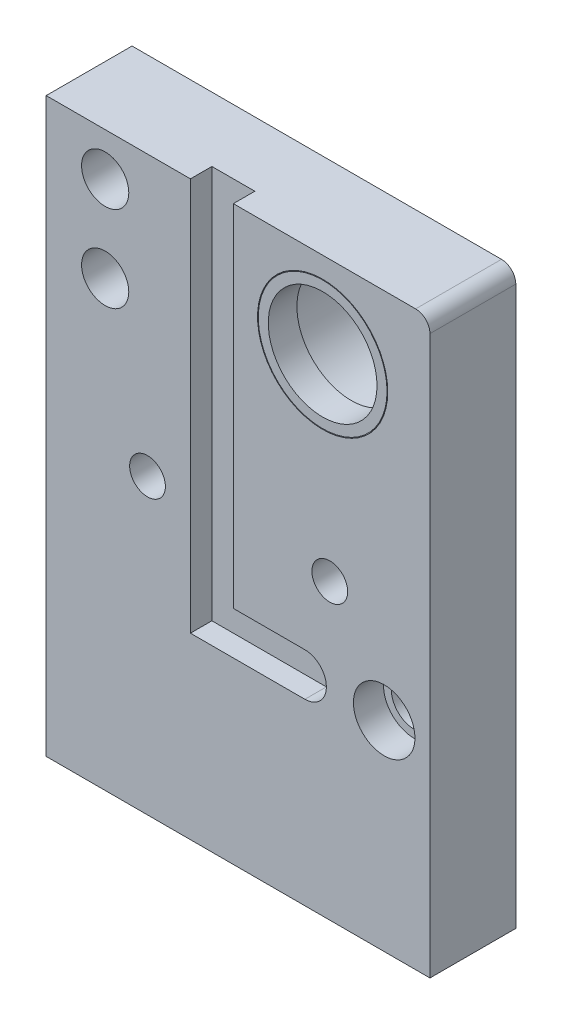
ISO-10303-21;
HEADER;
FILE_DESCRIPTION(('STEP AP214'),'2;1');
FILE_NAME('part.step','',(''),(''),'','','');
FILE_SCHEMA(('AUTOMOTIVE_DESIGN { 1 0 10303 214 1 1 1 1 }'));
ENDSEC;
DATA;
#1=APPLICATION_CONTEXT('core data for automotive mechanical design processes');
#2=APPLICATION_PROTOCOL_DEFINITION('international standard','automotive_design',2000,#1);
#3=PRODUCT_CONTEXT('',#1,'mechanical');
#4=PRODUCT('Part','Part','',(#3));
#5=PRODUCT_RELATED_PRODUCT_CATEGORY('part','',(#4));
#6=PRODUCT_DEFINITION_FORMATION('','',#4);
#7=PRODUCT_DEFINITION_CONTEXT('part definition',#1,'design');
#8=PRODUCT_DEFINITION('design','',#6,#7);
#9=PRODUCT_DEFINITION_SHAPE('','',#8);
#10=(LENGTH_UNIT() NAMED_UNIT(*) SI_UNIT(.MILLI.,.METRE.));
#11=(NAMED_UNIT(*) PLANE_ANGLE_UNIT() SI_UNIT($,.RADIAN.));
#12=(NAMED_UNIT(*) SI_UNIT($,.STERADIAN.) SOLID_ANGLE_UNIT());
#13=UNCERTAINTY_MEASURE_WITH_UNIT(LENGTH_MEASURE(1.E-05),#10,'distance_accuracy_value','');
#14=(GEOMETRIC_REPRESENTATION_CONTEXT(3) GLOBAL_UNCERTAINTY_ASSIGNED_CONTEXT((#13)) GLOBAL_UNIT_ASSIGNED_CONTEXT((#10,
#11,#12)) REPRESENTATION_CONTEXT('',''));
#15=CARTESIAN_POINT('',(0.,0.,0.));
#16=DIRECTION('',(0.,0.,1.));
#17=DIRECTION('',(1.,0.,0.));
#18=AXIS2_PLACEMENT_3D('',#15,#16,#17);
#19=CARTESIAN_POINT('',(19.32061,34.,4.));
#20=DIRECTION('',(0.,0.,1.));
#21=DIRECTION('',(1.,0.,0.));
#22=AXIS2_PLACEMENT_3D('',#19,#20,#21);
#23=CYLINDRICAL_SURFACE('',#22,4.50000000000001);
#24=CARTESIAN_POINT('',(19.32061,34.,4.));
#25=DIRECTION('',(0.,0.,1.));
#26=DIRECTION('',(1.,0.,0.));
#27=AXIS2_PLACEMENT_3D('',#24,#25,#26);
#28=CIRCLE('',#27,4.50000000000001);
#29=CARTESIAN_POINT('',(23.82061,34.,4.));
#30=VERTEX_POINT('',#29);
#31=EDGE_CURVE('E13',#30,#30,#28,.T.);
#32=ORIENTED_EDGE('',*,*,#31,.T.);
#33=EDGE_LOOP('',(#32));
#34=FACE_BOUND('',#33,.T.);
#35=CARTESIAN_POINT('',(19.32061,34.,6.));
#36=DIRECTION('',(0.,0.,1.));
#37=DIRECTION('',(1.,0.,0.));
#38=AXIS2_PLACEMENT_3D('',#35,#36,#37);
#39=CIRCLE('',#38,4.50000000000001);
#40=CARTESIAN_POINT('',(23.82061,34.,6.));
#41=VERTEX_POINT('',#40);
#42=EDGE_CURVE('E60',#41,#41,#39,.T.);
#43=ORIENTED_EDGE('',*,*,#42,.F.);
#44=EDGE_LOOP('',(#43));
#45=FACE_BOUND('',#44,.T.);
#46=ADVANCED_FACE('F57',(#34,#45),#23,.T.);
#47=CARTESIAN_POINT('',(19.32061,34.,4.));
#48=DIRECTION('',(0.,0.,1.));
#49=DIRECTION('',(1.,0.,0.));
#50=AXIS2_PLACEMENT_3D('',#47,#48,#49);
#51=PLANE('',#50);
#52=CARTESIAN_POINT('',(19.32061,34.,4.));
#53=DIRECTION('',(0.,0.,1.));
#54=DIRECTION('',(1.,0.,0.));
#55=AXIS2_PLACEMENT_3D('',#52,#53,#54);
#56=CIRCLE('',#55,3.8);
#57=CARTESIAN_POINT('',(23.12061,34.,4.));
#58=VERTEX_POINT('',#57);
#59=EDGE_CURVE('E67',#58,#58,#56,.T.);
#60=ORIENTED_EDGE('',*,*,#59,.T.);
#61=EDGE_LOOP('',(#60));
#62=FACE_BOUND('',#61,.T.);
#63=ORIENTED_EDGE('',*,*,#31,.F.);
#64=EDGE_LOOP('',(#63));
#65=FACE_BOUND('',#64,.T.);
#66=ADVANCED_FACE('F75',(#62,#65),#51,.F.);
#67=CARTESIAN_POINT('',(19.32061,34.,6.));
#68=DIRECTION('',(0.,0.,1.));
#69=DIRECTION('',(1.,0.,0.));
#70=AXIS2_PLACEMENT_3D('',#67,#68,#69);
#71=PLANE('',#70);
#72=CARTESIAN_POINT('',(19.32061,34.,6.));
#73=DIRECTION('',(0.,0.,1.));
#74=DIRECTION('',(1.,0.,0.));
#75=AXIS2_PLACEMENT_3D('',#72,#73,#74);
#76=CIRCLE('',#75,3.8);
#77=CARTESIAN_POINT('',(23.12061,34.,6.));
#78=VERTEX_POINT('',#77);
#79=EDGE_CURVE('E69',#78,#78,#76,.T.);
#80=ORIENTED_EDGE('',*,*,#79,.F.);
#81=EDGE_LOOP('',(#80));
#82=FACE_BOUND('',#81,.T.);
#83=ORIENTED_EDGE('',*,*,#42,.T.);
#84=EDGE_LOOP('',(#83));
#85=FACE_BOUND('',#84,.T.);
#86=ADVANCED_FACE('F81',(#82,#85),#71,.T.);
#87=CARTESIAN_POINT('',(19.32061,34.,4.));
#88=DIRECTION('',(0.,0.,1.));
#89=DIRECTION('',(1.,0.,0.));
#90=AXIS2_PLACEMENT_3D('',#87,#88,#89);
#91=CYLINDRICAL_SURFACE('',#90,3.8);
#92=ORIENTED_EDGE('',*,*,#59,.F.);
#93=EDGE_LOOP('',(#92));
#94=FACE_BOUND('',#93,.T.);
#95=ORIENTED_EDGE('',*,*,#79,.T.);
#96=EDGE_LOOP('',(#95));
#97=FACE_BOUND('',#96,.T.);
#98=ADVANCED_FACE('F78',(#94,#97),#91,.F.);
#99=CLOSED_SHELL('',(#46,#66,#86,#98));
#100=MANIFOLD_SOLID_BREP('B2',#99);
#101=CARTESIAN_POINT('',(23.62061,14.,6.));
#102=DIRECTION('',(0.,0.,-1.));
#103=DIRECTION('',(-1.,0.,0.));
#104=AXIS2_PLACEMENT_3D('',#101,#102,#103);
#105=CYLINDRICAL_SURFACE('',#104,1.6);
#106=CARTESIAN_POINT('',(23.62061,14.,0.));
#107=DIRECTION('',(0.,0.,1.));
#108=DIRECTION('',(1.,0.,0.));
#109=AXIS2_PLACEMENT_3D('',#106,#107,#108);
#110=CIRCLE('',#109,1.6);
#111=CARTESIAN_POINT('',(25.22061,14.,0.));
#112=VERTEX_POINT('',#111);
#113=EDGE_CURVE('E277',#112,#112,#110,.T.);
#114=ORIENTED_EDGE('',*,*,#113,.F.);
#115=EDGE_LOOP('',(#114));
#116=FACE_BOUND('',#115,.T.);
#117=CARTESIAN_POINT('',(23.62061,14.,3.9));
#118=DIRECTION('',(0.,0.,1.));
#119=DIRECTION('',(1.,0.,0.));
#120=AXIS2_PLACEMENT_3D('',#117,#118,#119);
#121=CIRCLE('',#120,1.6);
#122=CARTESIAN_POINT('',(25.22061,14.,3.9));
#123=VERTEX_POINT('',#122);
#124=EDGE_CURVE('E251',#123,#123,#121,.T.);
#125=ORIENTED_EDGE('',*,*,#124,.T.);
#126=EDGE_LOOP('',(#125));
#127=FACE_BOUND('',#126,.T.);
#128=ADVANCED_FACE('F125',(#116,#127),#105,.F.);
#129=CARTESIAN_POINT('',(0.,0.,6.));
#130=DIRECTION('',(0.,0.,-1.));
#131=DIRECTION('',(-1.,0.,0.));
#132=AXIS2_PLACEMENT_3D('',#129,#130,#131);
#133=PLANE('',#132);
#134=CARTESIAN_POINT('',(7.08031781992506,20.5,6.));
#135=DIRECTION('',(0.,0.,1.));
#136=DIRECTION('',(1.,0.,0.));
#137=AXIS2_PLACEMENT_3D('',#134,#135,#136);
#138=CIRCLE('',#137,1.25);
#139=CARTESIAN_POINT('',(8.33031781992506,20.5,6.));
#140=VERTEX_POINT('',#139);
#141=EDGE_CURVE('E343',#140,#140,#138,.T.);
#142=ORIENTED_EDGE('',*,*,#141,.F.);
#143=EDGE_LOOP('',(#142));
#144=FACE_BOUND('',#143,.T.);
#145=CARTESIAN_POINT('',(19.82061,20.5,6.));
#146=DIRECTION('',(0.,0.,1.));
#147=DIRECTION('',(1.,0.,0.));
#148=AXIS2_PLACEMENT_3D('',#145,#146,#147);
#149=CIRCLE('',#148,1.25);
#150=CARTESIAN_POINT('',(21.07061,20.5,6.));
#151=VERTEX_POINT('',#150);
#152=EDGE_CURVE('E348',#151,#151,#149,.T.);
#153=ORIENTED_EDGE('',*,*,#152,.F.);
#154=EDGE_LOOP('',(#153));
#155=FACE_BOUND('',#154,.T.);
#156=CARTESIAN_POINT('',(23.62061,14.,6.));
#157=DIRECTION('',(0.,0.,1.));
#158=DIRECTION('',(1.,0.,0.));
#159=AXIS2_PLACEMENT_3D('',#156,#157,#158);
#160=CIRCLE('',#159,2.15);
#161=CARTESIAN_POINT('',(25.77061,14.,6.));
#162=VERTEX_POINT('',#161);
#163=EDGE_CURVE('E252',#162,#162,#160,.T.);
#164=ORIENTED_EDGE('',*,*,#163,.F.);
#165=EDGE_LOOP('',(#164));
#166=FACE_BOUND('',#165,.T.);
#167=DIRECTION('',(-1.,0.,0.));
#168=VECTOR('',#167,1.);
#169=CARTESIAN_POINT('',(0.,40.,6.));
#170=LINE('',#169,#168);
#171=CARTESIAN_POINT('',(25.82061,40.,6.));
#172=VERTEX_POINT('',#171);
#173=CARTESIAN_POINT('',(13.0803178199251,40.,6.));
#174=VERTEX_POINT('',#173);
#175=EDGE_CURVE('E298',#172,#174,#170,.T.);
#176=ORIENTED_EDGE('',*,*,#175,.T.);
#177=DIRECTION('',(0.,1.,0.));
#178=VECTOR('',#177,1.);
#179=CARTESIAN_POINT('',(13.0803178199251,15.5,6.));
#180=LINE('',#179,#178);
#181=CARTESIAN_POINT('',(13.0803178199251,15.5,6.));
#182=VERTEX_POINT('',#181);
#183=EDGE_CURVE('E340',#182,#174,#180,.T.);
#184=ORIENTED_EDGE('',*,*,#183,.F.);
#185=DIRECTION('',(-1.,0.,0.));
#186=VECTOR('',#185,1.);
#187=CARTESIAN_POINT('',(13.0803178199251,15.5,6.));
#188=LINE('',#187,#186);
#189=CARTESIAN_POINT('',(18.0803178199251,15.5,6.));
#190=VERTEX_POINT('',#189);
#191=EDGE_CURVE('E355',#190,#182,#188,.T.);
#192=ORIENTED_EDGE('',*,*,#191,.F.);
#193=CARTESIAN_POINT('',(18.0803178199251,14.,6.));
#194=DIRECTION('',(0.,0.,-1.));
#195=DIRECTION('',(-1.,0.,0.));
#196=AXIS2_PLACEMENT_3D('',#193,#194,#195);
#197=CIRCLE('',#196,1.5);
#198=CARTESIAN_POINT('',(19.5803178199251,14.,6.));
#199=VERTEX_POINT('',#198);
#200=EDGE_CURVE('E55',#190,#199,#197,.T.);
#201=ORIENTED_EDGE('',*,*,#200,.T.);
#202=CARTESIAN_POINT('',(18.0803178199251,14.,6.));
#203=DIRECTION('',(0.,0.,-1.));
#204=DIRECTION('',(-1.,0.,0.));
#205=AXIS2_PLACEMENT_3D('',#202,#203,#204);
#206=CIRCLE('',#205,1.5);
#207=CARTESIAN_POINT('',(18.0803178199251,12.5,6.));
#208=VERTEX_POINT('',#207);
#209=EDGE_CURVE('E134',#199,#208,#206,.T.);
#210=ORIENTED_EDGE('',*,*,#209,.T.);
#211=DIRECTION('',(1.,0.,0.));
#212=VECTOR('',#211,1.);
#213=CARTESIAN_POINT('',(10.0803178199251,12.5,6.));
#214=LINE('',#213,#212);
#215=CARTESIAN_POINT('',(10.0803178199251,12.5,6.));
#216=VERTEX_POINT('',#215);
#217=EDGE_CURVE('E362',#216,#208,#214,.T.);
#218=ORIENTED_EDGE('',*,*,#217,.F.);
#219=DIRECTION('',(0.,-1.,0.));
#220=VECTOR('',#219,1.);
#221=CARTESIAN_POINT('',(10.0803178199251,12.5,6.));
#222=LINE('',#221,#220);
#223=CARTESIAN_POINT('',(10.0803178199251,40.,6.));
#224=VERTEX_POINT('',#223);
#225=EDGE_CURVE('E360',#224,#216,#222,.T.);
#226=ORIENTED_EDGE('',*,*,#225,.F.);
#227=CARTESIAN_POINT('',(0.,40.,6.));
#228=VERTEX_POINT('',#227);
#229=EDGE_CURVE('E239',#224,#228,#170,.T.);
#230=ORIENTED_EDGE('',*,*,#229,.T.);
#231=DIRECTION('',(0.,-1.,0.));
#232=VECTOR('',#231,1.);
#233=CARTESIAN_POINT('',(0.,0.,6.));
#234=LINE('',#233,#232);
#235=CARTESIAN_POINT('',(0.,0.,6.));
#236=VERTEX_POINT('',#235);
#237=EDGE_CURVE('E289',#228,#236,#234,.T.);
#238=ORIENTED_EDGE('',*,*,#237,.T.);
#239=DIRECTION('',(1.,0.,0.));
#240=VECTOR('',#239,1.);
#241=CARTESIAN_POINT('',(0.,0.,6.));
#242=LINE('',#241,#240);
#243=CARTESIAN_POINT('',(26.82061,0.,6.));
#244=VERTEX_POINT('',#243);
#245=EDGE_CURVE('E292',#236,#244,#242,.T.);
#246=ORIENTED_EDGE('',*,*,#245,.T.);
#247=DIRECTION('',(0.,1.,0.));
#248=VECTOR('',#247,1.);
#249=CARTESIAN_POINT('',(26.82061,0.,6.));
#250=LINE('',#249,#248);
#251=CARTESIAN_POINT('',(26.82061,39.,6.));
#252=VERTEX_POINT('',#251);
#253=EDGE_CURVE('E295',#244,#252,#250,.T.);
#254=ORIENTED_EDGE('',*,*,#253,.T.);
#255=CARTESIAN_POINT('',(25.82061,39.,6.));
#256=DIRECTION('',(0.,0.,-1.));
#257=DIRECTION('',(-1.,0.,0.));
#258=AXIS2_PLACEMENT_3D('',#255,#256,#257);
#259=CIRCLE('',#258,1.);
#260=EDGE_CURVE('E325',#252,#172,#259,.F.);
#261=ORIENTED_EDGE('',*,*,#260,.T.);
#262=EDGE_LOOP('',(#176,#184,#192,#201,#210,#218,#226,#230,#238,#246,#254,#261));
#263=FACE_BOUND('',#262,.T.);
#264=CARTESIAN_POINT('',(19.32061,34.,6.));
#265=DIRECTION('',(0.,0.,1.));
#266=DIRECTION('',(1.,0.,0.));
#267=AXIS2_PLACEMENT_3D('',#264,#265,#266);
#268=CIRCLE('',#267,4.55);
#269=CARTESIAN_POINT('',(23.87061,34.,6.));
#270=VERTEX_POINT('',#269);
#271=EDGE_CURVE('E283',#270,#270,#268,.T.);
#272=ORIENTED_EDGE('',*,*,#271,.F.);
#273=EDGE_LOOP('',(#272));
#274=FACE_BOUND('',#273,.T.);
#275=CARTESIAN_POINT('',(4.12182109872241,31.,6.));
#276=DIRECTION('',(0.,0.,1.));
#277=DIRECTION('',(1.,0.,0.));
#278=AXIS2_PLACEMENT_3D('',#275,#276,#277);
#279=CIRCLE('',#278,1.65);
#280=CARTESIAN_POINT('',(5.77182109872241,31.,6.));
#281=VERTEX_POINT('',#280);
#282=EDGE_CURVE('E274',#281,#281,#279,.T.);
#283=ORIENTED_EDGE('',*,*,#282,.F.);
#284=EDGE_LOOP('',(#283));
#285=FACE_BOUND('',#284,.T.);
#286=CARTESIAN_POINT('',(4.12182109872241,37.,6.));
#287=DIRECTION('',(0.,0.,1.));
#288=DIRECTION('',(1.,0.,0.));
#289=AXIS2_PLACEMENT_3D('',#286,#287,#288);
#290=CIRCLE('',#289,1.65);
#291=CARTESIAN_POINT('',(5.77182109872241,37.,6.));
#292=VERTEX_POINT('',#291);
#293=EDGE_CURVE('E268',#292,#292,#290,.T.);
#294=ORIENTED_EDGE('',*,*,#293,.F.);
#295=EDGE_LOOP('',(#294));
#296=FACE_BOUND('',#295,.T.);
#297=ADVANCED_FACE('F370',(#144,#155,#166,#263,#274,#285,#296),#133,.F.);
#298=CARTESIAN_POINT('',(0.,0.,0.));
#299=DIRECTION('',(0.,0.,-1.));
#300=DIRECTION('',(-1.,0.,0.));
#301=AXIS2_PLACEMENT_3D('',#298,#299,#300);
#302=PLANE('',#301);
#303=CARTESIAN_POINT('',(7.08031781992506,20.5,0.));
#304=DIRECTION('',(0.,0.,-1.));
#305=DIRECTION('',(-1.,0.,0.));
#306=AXIS2_PLACEMENT_3D('',#303,#304,#305);
#307=CIRCLE('',#306,1.25);
#308=CARTESIAN_POINT('',(5.83031781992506,20.5,0.));
#309=VERTEX_POINT('',#308);
#310=EDGE_CURVE('E129',#309,#309,#307,.T.);
#311=ORIENTED_EDGE('',*,*,#310,.F.);
#312=EDGE_LOOP('',(#311));
#313=FACE_BOUND('',#312,.T.);
#314=CARTESIAN_POINT('',(19.82061,20.5,0.));
#315=DIRECTION('',(0.,0.,-1.));
#316=DIRECTION('',(-1.,0.,0.));
#317=AXIS2_PLACEMENT_3D('',#314,#315,#316);
#318=CIRCLE('',#317,1.25);
#319=CARTESIAN_POINT('',(18.57061,20.5,0.));
#320=VERTEX_POINT('',#319);
#321=EDGE_CURVE('E341',#320,#320,#318,.T.);
#322=ORIENTED_EDGE('',*,*,#321,.F.);
#323=EDGE_LOOP('',(#322));
#324=FACE_BOUND('',#323,.T.);
#325=CARTESIAN_POINT('',(4.12182109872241,31.,0.));
#326=DIRECTION('',(0.,0.,1.));
#327=DIRECTION('',(1.,0.,0.));
#328=AXIS2_PLACEMENT_3D('',#325,#326,#327);
#329=CIRCLE('',#328,1.65);
#330=CARTESIAN_POINT('',(5.77182109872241,31.,0.));
#331=VERTEX_POINT('',#330);
#332=EDGE_CURVE('E271',#331,#331,#329,.T.);
#333=ORIENTED_EDGE('',*,*,#332,.T.);
#334=EDGE_LOOP('',(#333));
#335=FACE_BOUND('',#334,.T.);
#336=CARTESIAN_POINT('',(19.32061,34.,0.));
#337=DIRECTION('',(0.,0.,1.));
#338=DIRECTION('',(1.,0.,0.));
#339=AXIS2_PLACEMENT_3D('',#336,#337,#338);
#340=CIRCLE('',#339,4.55);
#341=CARTESIAN_POINT('',(23.87061,34.,0.));
#342=VERTEX_POINT('',#341);
#343=EDGE_CURVE('E282',#342,#342,#340,.T.);
#344=ORIENTED_EDGE('',*,*,#343,.T.);
#345=EDGE_LOOP('',(#344));
#346=FACE_BOUND('',#345,.T.);
#347=DIRECTION('',(-1.,0.,0.));
#348=VECTOR('',#347,1.);
#349=CARTESIAN_POINT('',(0.,40.,0.));
#350=LINE('',#349,#348);
#351=CARTESIAN_POINT('',(25.82061,40.,0.));
#352=VERTEX_POINT('',#351);
#353=CARTESIAN_POINT('',(0.,40.,0.));
#354=VERTEX_POINT('',#353);
#355=EDGE_CURVE('E293',#352,#354,#350,.T.);
#356=ORIENTED_EDGE('',*,*,#355,.F.);
#357=CARTESIAN_POINT('',(25.82061,39.,0.));
#358=DIRECTION('',(0.,0.,-1.));
#359=DIRECTION('',(-1.,0.,0.));
#360=AXIS2_PLACEMENT_3D('',#357,#358,#359);
#361=CIRCLE('',#360,1.);
#362=CARTESIAN_POINT('',(26.82061,39.,0.));
#363=VERTEX_POINT('',#362);
#364=EDGE_CURVE('E321',#352,#363,#361,.T.);
#365=ORIENTED_EDGE('',*,*,#364,.T.);
#366=DIRECTION('',(0.,1.,0.));
#367=VECTOR('',#366,1.);
#368=CARTESIAN_POINT('',(26.82061,0.,0.));
#369=LINE('',#368,#367);
#370=CARTESIAN_POINT('',(26.82061,0.,0.));
#371=VERTEX_POINT('',#370);
#372=EDGE_CURVE('E306',#371,#363,#369,.T.);
#373=ORIENTED_EDGE('',*,*,#372,.F.);
#374=DIRECTION('',(1.,0.,0.));
#375=VECTOR('',#374,1.);
#376=CARTESIAN_POINT('',(0.,0.,0.));
#377=LINE('',#376,#375);
#378=CARTESIAN_POINT('',(0.,0.,0.));
#379=VERTEX_POINT('',#378);
#380=EDGE_CURVE('E304',#379,#371,#377,.T.);
#381=ORIENTED_EDGE('',*,*,#380,.F.);
#382=DIRECTION('',(0.,-1.,0.));
#383=VECTOR('',#382,1.);
#384=CARTESIAN_POINT('',(0.,0.,0.));
#385=LINE('',#384,#383);
#386=EDGE_CURVE('E286',#354,#379,#385,.T.);
#387=ORIENTED_EDGE('',*,*,#386,.F.);
#388=EDGE_LOOP('',(#356,#365,#373,#381,#387));
#389=FACE_BOUND('',#388,.T.);
#390=ORIENTED_EDGE('',*,*,#113,.T.);
#391=EDGE_LOOP('',(#390));
#392=FACE_BOUND('',#391,.T.);
#393=CARTESIAN_POINT('',(4.12182109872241,37.,0.));
#394=DIRECTION('',(0.,0.,1.));
#395=DIRECTION('',(1.,0.,0.));
#396=AXIS2_PLACEMENT_3D('',#393,#394,#395);
#397=CIRCLE('',#396,1.65);
#398=CARTESIAN_POINT('',(5.77182109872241,37.,0.));
#399=VERTEX_POINT('',#398);
#400=EDGE_CURVE('E258',#399,#399,#397,.T.);
#401=ORIENTED_EDGE('',*,*,#400,.T.);
#402=EDGE_LOOP('',(#401));
#403=FACE_BOUND('',#402,.T.);
#404=ADVANCED_FACE('F381',(#313,#324,#335,#346,#389,#392,#403),#302,.T.);
#405=CARTESIAN_POINT('',(0.,0.,6.));
#406=DIRECTION('',(1.,0.,0.));
#407=DIRECTION('',(0.,0.,-1.));
#408=AXIS2_PLACEMENT_3D('',#405,#406,#407);
#409=PLANE('',#408);
#410=ORIENTED_EDGE('',*,*,#386,.T.);
#411=DIRECTION('',(0.,0.,-1.));
#412=VECTOR('',#411,1.);
#413=CARTESIAN_POINT('',(0.,0.,6.));
#414=LINE('',#413,#412);
#415=EDGE_CURVE('E315',#236,#379,#414,.T.);
#416=ORIENTED_EDGE('',*,*,#415,.F.);
#417=ORIENTED_EDGE('',*,*,#237,.F.);
#418=DIRECTION('',(0.,0.,-1.));
#419=VECTOR('',#418,1.);
#420=CARTESIAN_POINT('',(0.,40.,6.));
#421=LINE('',#420,#419);
#422=EDGE_CURVE('E301',#228,#354,#421,.T.);
#423=ORIENTED_EDGE('',*,*,#422,.T.);
#424=EDGE_LOOP('',(#410,#416,#417,#423));
#425=FACE_BOUND('',#424,.T.);
#426=ADVANCED_FACE('F392',(#425),#409,.F.);
#427=CARTESIAN_POINT('',(0.,0.,6.));
#428=DIRECTION('',(0.,1.,0.));
#429=DIRECTION('',(0.,0.,1.));
#430=AXIS2_PLACEMENT_3D('',#427,#428,#429);
#431=PLANE('',#430);
#432=CARTESIAN_POINT('',(3.,0.,3.));
#433=DIRECTION('',(0.,-1.,0.));
#434=DIRECTION('',(0.,0.,-1.));
#435=AXIS2_PLACEMENT_3D('',#432,#433,#434);
#436=CIRCLE('',#435,1.3);
#437=CARTESIAN_POINT('',(3.,0.,1.7));
#438=VERTEX_POINT('',#437);
#439=EDGE_CURVE('E259',#438,#438,#436,.T.);
#440=ORIENTED_EDGE('',*,*,#439,.F.);
#441=EDGE_LOOP('',(#440));
#442=FACE_BOUND('',#441,.T.);
#443=CARTESIAN_POINT('',(11.6,0.,3.));
#444=DIRECTION('',(0.,-1.,0.));
#445=DIRECTION('',(0.,0.,-1.));
#446=AXIS2_PLACEMENT_3D('',#443,#444,#445);
#447=CIRCLE('',#446,1.3);
#448=CARTESIAN_POINT('',(11.6,0.,1.7));
#449=VERTEX_POINT('',#448);
#450=EDGE_CURVE('E265',#449,#449,#447,.T.);
#451=ORIENTED_EDGE('',*,*,#450,.F.);
#452=EDGE_LOOP('',(#451));
#453=FACE_BOUND('',#452,.T.);
#454=ORIENTED_EDGE('',*,*,#380,.T.);
#455=DIRECTION('',(0.,0.,-1.));
#456=VECTOR('',#455,1.);
#457=CARTESIAN_POINT('',(26.82061,0.,6.));
#458=LINE('',#457,#456);
#459=EDGE_CURVE('E312',#244,#371,#458,.T.);
#460=ORIENTED_EDGE('',*,*,#459,.F.);
#461=ORIENTED_EDGE('',*,*,#245,.F.);
#462=ORIENTED_EDGE('',*,*,#415,.T.);
#463=EDGE_LOOP('',(#454,#460,#461,#462));
#464=FACE_BOUND('',#463,.T.);
#465=ADVANCED_FACE('F389',(#442,#453,#464),#431,.F.);
#466=CARTESIAN_POINT('',(26.82061,0.,6.));
#467=DIRECTION('',(-1.,0.,0.));
#468=DIRECTION('',(0.,0.,1.));
#469=AXIS2_PLACEMENT_3D('',#466,#467,#468);
#470=PLANE('',#469);
#471=ORIENTED_EDGE('',*,*,#372,.T.);
#472=DIRECTION('',(0.,0.,-1.));
#473=VECTOR('',#472,1.);
#474=CARTESIAN_POINT('',(26.82061,39.,6.));
#475=LINE('',#474,#473);
#476=EDGE_CURVE('E323',#363,#252,#475,.F.);
#477=ORIENTED_EDGE('',*,*,#476,.T.);
#478=ORIENTED_EDGE('',*,*,#253,.F.);
#479=ORIENTED_EDGE('',*,*,#459,.T.);
#480=EDGE_LOOP('',(#471,#477,#478,#479));
#481=FACE_BOUND('',#480,.T.);
#482=ADVANCED_FACE('F385',(#481),#470,.F.);
#483=CARTESIAN_POINT('',(0.,40.,6.));
#484=DIRECTION('',(0.,-1.,0.));
#485=DIRECTION('',(0.,0.,-1.));
#486=AXIS2_PLACEMENT_3D('',#483,#484,#485);
#487=PLANE('',#486);
#488=DIRECTION('',(-1.,0.,0.));
#489=VECTOR('',#488,1.);
#490=CARTESIAN_POINT('',(13.0803178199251,40.,4.5));
#491=LINE('',#490,#489);
#492=CARTESIAN_POINT('',(13.0803178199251,40.,4.5));
#493=VERTEX_POINT('',#492);
#494=CARTESIAN_POINT('',(10.0803178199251,40.,4.5));
#495=VERTEX_POINT('',#494);
#496=EDGE_CURVE('E226',#493,#495,#491,.T.);
#497=ORIENTED_EDGE('',*,*,#496,.F.);
#498=DIRECTION('',(0.,0.,1.));
#499=VECTOR('',#498,1.);
#500=CARTESIAN_POINT('',(13.0803178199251,40.,4.5));
#501=LINE('',#500,#499);
#502=EDGE_CURVE('E240',#493,#174,#501,.T.);
#503=ORIENTED_EDGE('',*,*,#502,.T.);
#504=ORIENTED_EDGE('',*,*,#175,.F.);
#505=DIRECTION('',(0.,0.,-1.));
#506=VECTOR('',#505,1.);
#507=CARTESIAN_POINT('',(25.82061,40.,6.));
#508=LINE('',#507,#506);
#509=EDGE_CURVE('E318',#172,#352,#508,.T.);
#510=ORIENTED_EDGE('',*,*,#509,.T.);
#511=ORIENTED_EDGE('',*,*,#355,.T.);
#512=ORIENTED_EDGE('',*,*,#422,.F.);
#513=ORIENTED_EDGE('',*,*,#229,.F.);
#514=DIRECTION('',(0.,0.,1.));
#515=VECTOR('',#514,1.);
#516=CARTESIAN_POINT('',(10.0803178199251,40.,4.5));
#517=LINE('',#516,#515);
#518=EDGE_CURVE('E219',#495,#224,#517,.T.);
#519=ORIENTED_EDGE('',*,*,#518,.F.);
#520=EDGE_LOOP('',(#497,#503,#504,#510,#511,#512,#513,#519));
#521=FACE_BOUND('',#520,.T.);
#522=ADVANCED_FACE('F237',(#521),#487,.F.);
#523=CARTESIAN_POINT('',(19.32061,34.,6.));
#524=DIRECTION('',(0.,0.,-1.));
#525=DIRECTION('',(-1.,0.,0.));
#526=AXIS2_PLACEMENT_3D('',#523,#524,#525);
#527=CYLINDRICAL_SURFACE('',#526,4.55);
#528=ORIENTED_EDGE('',*,*,#271,.T.);
#529=EDGE_LOOP('',(#528));
#530=FACE_BOUND('',#529,.T.);
#531=ORIENTED_EDGE('',*,*,#343,.F.);
#532=EDGE_LOOP('',(#531));
#533=FACE_BOUND('',#532,.T.);
#534=ADVANCED_FACE('F424',(#530,#533),#527,.F.);
#535=CARTESIAN_POINT('',(4.12182109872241,31.,6.));
#536=DIRECTION('',(0.,0.,-1.));
#537=DIRECTION('',(-1.,0.,0.));
#538=AXIS2_PLACEMENT_3D('',#535,#536,#537);
#539=CYLINDRICAL_SURFACE('',#538,1.65);
#540=ORIENTED_EDGE('',*,*,#282,.T.);
#541=EDGE_LOOP('',(#540));
#542=FACE_BOUND('',#541,.T.);
#543=ORIENTED_EDGE('',*,*,#332,.F.);
#544=EDGE_LOOP('',(#543));
#545=FACE_BOUND('',#544,.T.);
#546=ADVANCED_FACE('F422',(#542,#545),#539,.F.);
#547=CARTESIAN_POINT('',(4.12182109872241,37.,6.));
#548=DIRECTION('',(0.,0.,-1.));
#549=DIRECTION('',(-1.,0.,0.));
#550=AXIS2_PLACEMENT_3D('',#547,#548,#549);
#551=CYLINDRICAL_SURFACE('',#550,1.65);
#552=ORIENTED_EDGE('',*,*,#293,.T.);
#553=EDGE_LOOP('',(#552));
#554=FACE_BOUND('',#553,.T.);
#555=ORIENTED_EDGE('',*,*,#400,.F.);
#556=EDGE_LOOP('',(#555));
#557=FACE_BOUND('',#556,.T.);
#558=ADVANCED_FACE('F442',(#554,#557),#551,.F.);
#559=CARTESIAN_POINT('',(25.82061,39.,6.));
#560=DIRECTION('',(0.,0.,-1.));
#561=DIRECTION('',(-1.,0.,0.));
#562=AXIS2_PLACEMENT_3D('',#559,#560,#561);
#563=CYLINDRICAL_SURFACE('',#562,1.);
#564=ORIENTED_EDGE('',*,*,#260,.F.);
#565=ORIENTED_EDGE('',*,*,#476,.F.);
#566=ORIENTED_EDGE('',*,*,#364,.F.);
#567=ORIENTED_EDGE('',*,*,#509,.F.);
#568=EDGE_LOOP('',(#564,#565,#566,#567));
#569=FACE_BOUND('',#568,.T.);
#570=ADVANCED_FACE('F377',(#569),#563,.T.);
#571=CARTESIAN_POINT('',(11.6,8.,3.));
#572=DIRECTION('',(0.,-1.,0.));
#573=DIRECTION('',(0.,0.,-1.));
#574=AXIS2_PLACEMENT_3D('',#571,#572,#573);
#575=CYLINDRICAL_SURFACE('',#574,1.3);
#576=CARTESIAN_POINT('',(11.6,8.,3.));
#577=DIRECTION('',(0.,-1.,0.));
#578=DIRECTION('',(0.,0.,-1.));
#579=AXIS2_PLACEMENT_3D('',#576,#577,#578);
#580=CIRCLE('',#579,1.3);
#581=CARTESIAN_POINT('',(11.6,8.,1.7));
#582=VERTEX_POINT('',#581);
#583=EDGE_CURVE('E262',#582,#582,#580,.T.);
#584=ORIENTED_EDGE('',*,*,#583,.F.);
#585=EDGE_LOOP('',(#584));
#586=FACE_BOUND('',#585,.T.);
#587=ORIENTED_EDGE('',*,*,#450,.T.);
#588=EDGE_LOOP('',(#587));
#589=FACE_BOUND('',#588,.T.);
#590=ADVANCED_FACE('F441',(#586,#589),#575,.F.);
#591=CARTESIAN_POINT('',(11.6,8.,3.));
#592=DIRECTION('',(0.,-1.,0.));
#593=DIRECTION('',(0.,0.,-1.));
#594=AXIS2_PLACEMENT_3D('',#591,#592,#593);
#595=PLANE('',#594);
#596=ORIENTED_EDGE('',*,*,#583,.T.);
#597=EDGE_LOOP('',(#596));
#598=FACE_BOUND('',#597,.T.);
#599=ADVANCED_FACE('F447',(#598),#595,.T.);
#600=CARTESIAN_POINT('',(3.,8.,3.));
#601=DIRECTION('',(0.,-1.,0.));
#602=DIRECTION('',(0.,0.,-1.));
#603=AXIS2_PLACEMENT_3D('',#600,#601,#602);
#604=CYLINDRICAL_SURFACE('',#603,1.3);
#605=CARTESIAN_POINT('',(3.,8.,3.));
#606=DIRECTION('',(0.,-1.,0.));
#607=DIRECTION('',(0.,0.,-1.));
#608=AXIS2_PLACEMENT_3D('',#605,#606,#607);
#609=CIRCLE('',#608,1.3);
#610=CARTESIAN_POINT('',(3.,8.,1.7));
#611=VERTEX_POINT('',#610);
#612=EDGE_CURVE('E255',#611,#611,#609,.T.);
#613=ORIENTED_EDGE('',*,*,#612,.F.);
#614=EDGE_LOOP('',(#613));
#615=FACE_BOUND('',#614,.T.);
#616=ORIENTED_EDGE('',*,*,#439,.T.);
#617=EDGE_LOOP('',(#616));
#618=FACE_BOUND('',#617,.T.);
#619=ADVANCED_FACE('F459',(#615,#618),#604,.F.);
#620=CARTESIAN_POINT('',(3.,8.,3.));
#621=DIRECTION('',(0.,-1.,0.));
#622=DIRECTION('',(0.,0.,-1.));
#623=AXIS2_PLACEMENT_3D('',#620,#621,#622);
#624=PLANE('',#623);
#625=ORIENTED_EDGE('',*,*,#612,.T.);
#626=EDGE_LOOP('',(#625));
#627=FACE_BOUND('',#626,.T.);
#628=ADVANCED_FACE('F463',(#627),#624,.T.);
#629=CARTESIAN_POINT('',(23.62061,14.,3.9));
#630=DIRECTION('',(0.,0.,1.));
#631=DIRECTION('',(1.,0.,0.));
#632=AXIS2_PLACEMENT_3D('',#629,#630,#631);
#633=CYLINDRICAL_SURFACE('',#632,2.15);
#634=CARTESIAN_POINT('',(23.62061,14.,3.9));
#635=DIRECTION('',(0.,0.,1.));
#636=DIRECTION('',(1.,0.,0.));
#637=AXIS2_PLACEMENT_3D('',#634,#635,#636);
#638=CIRCLE('',#637,2.15);
#639=CARTESIAN_POINT('',(25.77061,14.,3.9));
#640=VERTEX_POINT('',#639);
#641=EDGE_CURVE('E248',#640,#640,#638,.T.);
#642=ORIENTED_EDGE('',*,*,#641,.F.);
#643=EDGE_LOOP('',(#642));
#644=FACE_BOUND('',#643,.T.);
#645=ORIENTED_EDGE('',*,*,#163,.T.);
#646=EDGE_LOOP('',(#645));
#647=FACE_BOUND('',#646,.T.);
#648=ADVANCED_FACE('F467',(#644,#647),#633,.F.);
#649=CARTESIAN_POINT('',(23.62061,14.,3.9));
#650=DIRECTION('',(0.,0.,1.));
#651=DIRECTION('',(1.,0.,0.));
#652=AXIS2_PLACEMENT_3D('',#649,#650,#651);
#653=PLANE('',#652);
#654=ORIENTED_EDGE('',*,*,#124,.F.);
#655=EDGE_LOOP('',(#654));
#656=FACE_BOUND('',#655,.T.);
#657=ORIENTED_EDGE('',*,*,#641,.T.);
#658=EDGE_LOOP('',(#657));
#659=FACE_BOUND('',#658,.T.);
#660=ADVANCED_FACE('F471',(#656,#659),#653,.T.);
#661=CARTESIAN_POINT('',(13.0803178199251,15.5,4.5));
#662=DIRECTION('',(1.,0.,0.));
#663=DIRECTION('',(0.,0.,-1.));
#664=AXIS2_PLACEMENT_3D('',#661,#662,#663);
#665=PLANE('',#664);
#666=ORIENTED_EDGE('',*,*,#183,.T.);
#667=ORIENTED_EDGE('',*,*,#502,.F.);
#668=DIRECTION('',(0.,1.,0.));
#669=VECTOR('',#668,1.);
#670=CARTESIAN_POINT('',(13.0803178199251,15.5,4.5));
#671=LINE('',#670,#669);
#672=CARTESIAN_POINT('',(13.0803178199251,15.5,4.5));
#673=VERTEX_POINT('',#672);
#674=EDGE_CURVE('E231',#673,#493,#671,.T.);
#675=ORIENTED_EDGE('',*,*,#674,.F.);
#676=DIRECTION('',(0.,0.,1.));
#677=VECTOR('',#676,1.);
#678=CARTESIAN_POINT('',(13.0803178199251,15.5,4.5));
#679=LINE('',#678,#677);
#680=EDGE_CURVE('E242',#673,#182,#679,.T.);
#681=ORIENTED_EDGE('',*,*,#680,.T.);
#682=EDGE_LOOP('',(#666,#667,#675,#681));
#683=FACE_BOUND('',#682,.T.);
#684=ADVANCED_FACE('F369',(#683),#665,.F.);
#685=CARTESIAN_POINT('',(13.0803178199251,15.5,4.5));
#686=DIRECTION('',(0.,1.,0.));
#687=DIRECTION('',(0.,0.,1.));
#688=AXIS2_PLACEMENT_3D('',#685,#686,#687);
#689=PLANE('',#688);
#690=DIRECTION('',(-1.,0.,0.));
#691=VECTOR('',#690,1.);
#692=CARTESIAN_POINT('',(13.0803178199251,15.5,4.5));
#693=LINE('',#692,#691);
#694=CARTESIAN_POINT('',(18.0803178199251,15.5,4.5));
#695=VERTEX_POINT('',#694);
#696=EDGE_CURVE('E244',#695,#673,#693,.T.);
#697=ORIENTED_EDGE('',*,*,#696,.F.);
#698=DIRECTION('',(0.,0.,1.));
#699=VECTOR('',#698,1.);
#700=CARTESIAN_POINT('',(18.0803178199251,15.5,6.));
#701=LINE('',#700,#699);
#702=EDGE_CURVE('E148',#695,#190,#701,.T.);
#703=ORIENTED_EDGE('',*,*,#702,.T.);
#704=ORIENTED_EDGE('',*,*,#191,.T.);
#705=ORIENTED_EDGE('',*,*,#680,.F.);
#706=EDGE_LOOP('',(#697,#703,#704,#705));
#707=FACE_BOUND('',#706,.T.);
#708=ADVANCED_FACE('F478',(#707),#689,.F.);
#709=CARTESIAN_POINT('',(10.0803178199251,12.5,4.5));
#710=DIRECTION('',(0.,-1.,0.));
#711=DIRECTION('',(0.,0.,-1.));
#712=AXIS2_PLACEMENT_3D('',#709,#710,#711);
#713=PLANE('',#712);
#714=ORIENTED_EDGE('',*,*,#217,.T.);
#715=DIRECTION('',(0.,0.,1.));
#716=VECTOR('',#715,1.);
#717=CARTESIAN_POINT('',(18.0803178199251,12.5,4.5));
#718=LINE('',#717,#716);
#719=CARTESIAN_POINT('',(18.0803178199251,12.5,4.5));
#720=VERTEX_POINT('',#719);
#721=EDGE_CURVE('E327',#208,#720,#718,.F.);
#722=ORIENTED_EDGE('',*,*,#721,.T.);
#723=DIRECTION('',(1.,0.,0.));
#724=VECTOR('',#723,1.);
#725=CARTESIAN_POINT('',(10.0803178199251,12.5,4.5));
#726=LINE('',#725,#724);
#727=CARTESIAN_POINT('',(10.0803178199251,12.5,4.5));
#728=VERTEX_POINT('',#727);
#729=EDGE_CURVE('E225',#728,#720,#726,.T.);
#730=ORIENTED_EDGE('',*,*,#729,.F.);
#731=DIRECTION('',(0.,0.,1.));
#732=VECTOR('',#731,1.);
#733=CARTESIAN_POINT('',(10.0803178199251,12.5,4.5));
#734=LINE('',#733,#732);
#735=EDGE_CURVE('E221',#728,#216,#734,.T.);
#736=ORIENTED_EDGE('',*,*,#735,.T.);
#737=EDGE_LOOP('',(#714,#722,#730,#736));
#738=FACE_BOUND('',#737,.T.);
#739=ADVANCED_FACE('F398',(#738),#713,.F.);
#740=CARTESIAN_POINT('',(10.0803178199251,12.5,4.5));
#741=DIRECTION('',(-1.,0.,0.));
#742=DIRECTION('',(0.,0.,1.));
#743=AXIS2_PLACEMENT_3D('',#740,#741,#742);
#744=PLANE('',#743);
#745=ORIENTED_EDGE('',*,*,#225,.T.);
#746=ORIENTED_EDGE('',*,*,#735,.F.);
#747=DIRECTION('',(0.,-1.,0.));
#748=VECTOR('',#747,1.);
#749=CARTESIAN_POINT('',(10.0803178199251,12.5,4.5));
#750=LINE('',#749,#748);
#751=EDGE_CURVE('E214',#495,#728,#750,.T.);
#752=ORIENTED_EDGE('',*,*,#751,.F.);
#753=ORIENTED_EDGE('',*,*,#518,.T.);
#754=EDGE_LOOP('',(#745,#746,#752,#753));
#755=FACE_BOUND('',#754,.T.);
#756=ADVANCED_FACE('F217',(#755),#744,.F.);
#757=CARTESIAN_POINT('',(0.,0.,4.5));
#758=DIRECTION('',(0.,0.,1.));
#759=DIRECTION('',(1.,0.,0.));
#760=AXIS2_PLACEMENT_3D('',#757,#758,#759);
#761=PLANE('',#760);
#762=ORIENTED_EDGE('',*,*,#729,.T.);
#763=CARTESIAN_POINT('',(18.0803178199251,14.,4.5));
#764=DIRECTION('',(0.,0.,1.));
#765=DIRECTION('',(1.,0.,0.));
#766=AXIS2_PLACEMENT_3D('',#763,#764,#765);
#767=CIRCLE('',#766,1.5);
#768=CARTESIAN_POINT('',(19.5803178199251,14.,4.5));
#769=VERTEX_POINT('',#768);
#770=EDGE_CURVE('E334',#720,#769,#767,.T.);
#771=ORIENTED_EDGE('',*,*,#770,.T.);
#772=CARTESIAN_POINT('',(18.0803178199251,14.,4.5));
#773=DIRECTION('',(0.,0.,1.));
#774=DIRECTION('',(1.,0.,0.));
#775=AXIS2_PLACEMENT_3D('',#772,#773,#774);
#776=CIRCLE('',#775,1.5);
#777=EDGE_CURVE('E332',#769,#695,#776,.T.);
#778=ORIENTED_EDGE('',*,*,#777,.T.);
#779=ORIENTED_EDGE('',*,*,#696,.T.);
#780=ORIENTED_EDGE('',*,*,#674,.T.);
#781=ORIENTED_EDGE('',*,*,#496,.T.);
#782=ORIENTED_EDGE('',*,*,#751,.T.);
#783=EDGE_LOOP('',(#762,#771,#778,#779,#780,#781,#782));
#784=FACE_BOUND('',#783,.T.);
#785=ADVANCED_FACE('F229',(#784),#761,.T.);
#786=CARTESIAN_POINT('',(18.0803178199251,14.,4.5));
#787=DIRECTION('',(0.,0.,-1.));
#788=DIRECTION('',(-1.,0.,0.));
#789=AXIS2_PLACEMENT_3D('',#786,#787,#788);
#790=CYLINDRICAL_SURFACE('',#789,1.5);
#791=ORIENTED_EDGE('',*,*,#702,.F.);
#792=ORIENTED_EDGE('',*,*,#777,.F.);
#793=DIRECTION('',(0.,0.,1.));
#794=VECTOR('',#793,1.);
#795=CARTESIAN_POINT('',(19.5803178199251,14.,4.5));
#796=LINE('',#795,#794);
#797=EDGE_CURVE('E338',#199,#769,#796,.F.);
#798=ORIENTED_EDGE('',*,*,#797,.F.);
#799=ORIENTED_EDGE('',*,*,#200,.F.);
#800=EDGE_LOOP('',(#791,#792,#798,#799));
#801=FACE_BOUND('',#800,.T.);
#802=ADVANCED_FACE('F127',(#801),#790,.F.);
#803=CARTESIAN_POINT('',(18.0803178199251,14.,4.5));
#804=DIRECTION('',(0.,0.,-1.));
#805=DIRECTION('',(-1.,0.,0.));
#806=AXIS2_PLACEMENT_3D('',#803,#804,#805);
#807=CYLINDRICAL_SURFACE('',#806,1.5);
#808=ORIENTED_EDGE('',*,*,#770,.F.);
#809=ORIENTED_EDGE('',*,*,#721,.F.);
#810=ORIENTED_EDGE('',*,*,#209,.F.);
#811=ORIENTED_EDGE('',*,*,#797,.T.);
#812=EDGE_LOOP('',(#808,#809,#810,#811));
#813=FACE_BOUND('',#812,.T.);
#814=ADVANCED_FACE('F400',(#813),#807,.F.);
#815=CARTESIAN_POINT('',(19.82061,20.5,-4.));
#816=DIRECTION('',(0.,0.,1.));
#817=DIRECTION('',(1.,0.,0.));
#818=AXIS2_PLACEMENT_3D('',#815,#816,#817);
#819=CYLINDRICAL_SURFACE('',#818,1.25);
#820=ORIENTED_EDGE('',*,*,#321,.T.);
#821=EDGE_LOOP('',(#820));
#822=FACE_BOUND('',#821,.T.);
#823=ORIENTED_EDGE('',*,*,#152,.T.);
#824=EDGE_LOOP('',(#823));
#825=FACE_BOUND('',#824,.T.);
#826=ADVANCED_FACE('F408',(#822,#825),#819,.F.);
#827=CARTESIAN_POINT('',(7.08031781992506,20.5,-4.));
#828=DIRECTION('',(0.,0.,1.));
#829=DIRECTION('',(1.,0.,0.));
#830=AXIS2_PLACEMENT_3D('',#827,#828,#829);
#831=CYLINDRICAL_SURFACE('',#830,1.25);
#832=ORIENTED_EDGE('',*,*,#310,.T.);
#833=EDGE_LOOP('',(#832));
#834=FACE_BOUND('',#833,.T.);
#835=ORIENTED_EDGE('',*,*,#141,.T.);
#836=EDGE_LOOP('',(#835));
#837=FACE_BOUND('',#836,.T.);
#838=ADVANCED_FACE('F487',(#834,#837),#831,.F.);
#839=CLOSED_SHELL('',(#128,#297,#404,#426,#465,#482,#522,#534,#546,#558,#570,#590,#599,#619,
#628,#648,#660,#684,#708,#739,#756,#785,#802,#814,#826,#838));
#840=MANIFOLD_SOLID_BREP('B8',#839);
#841=ADVANCED_BREP_SHAPE_REPRESENTATION('',(#18,#100,#840),#14);
#842=SHAPE_DEFINITION_REPRESENTATION(#9,#841);
ENDSEC;
END-ISO-10303-21;
